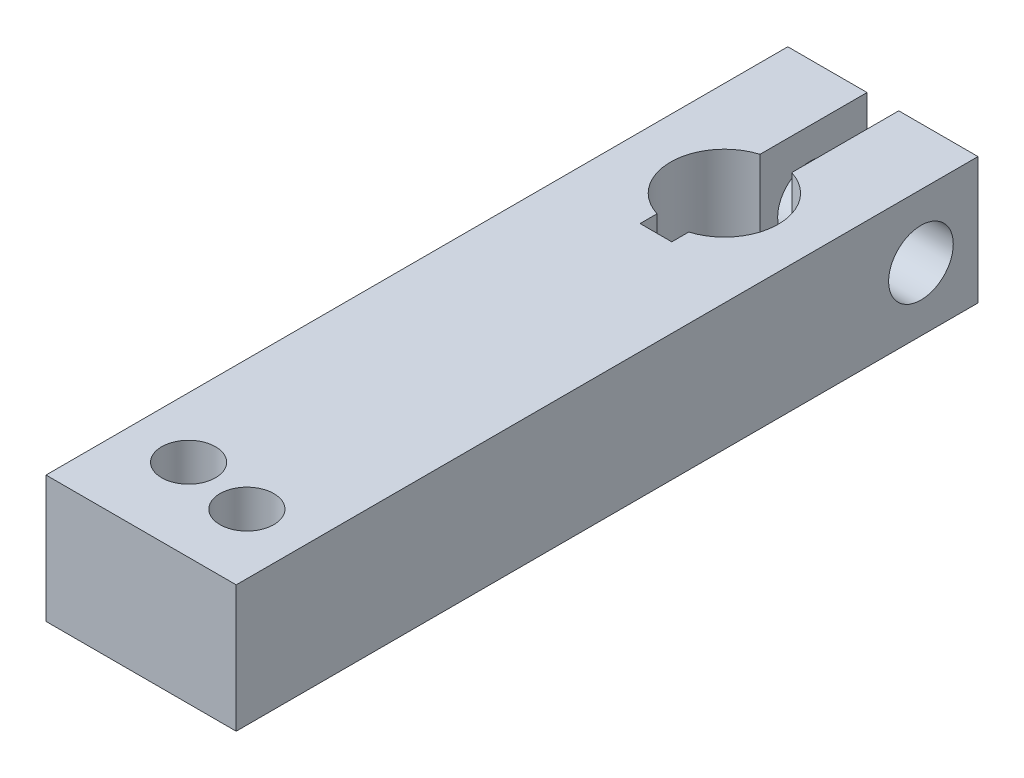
ISO-10303-21;
HEADER;
FILE_DESCRIPTION(('STEP AP214'),'2;1');
FILE_NAME('part.step','',(''),(''),'','','');
FILE_SCHEMA(('AUTOMOTIVE_DESIGN { 1 0 10303 214 1 1 1 1 }'));
ENDSEC;
DATA;
#1=APPLICATION_CONTEXT('core data for automotive mechanical design processes');
#2=APPLICATION_PROTOCOL_DEFINITION('international standard','automotive_design',2000,#1);
#3=PRODUCT_CONTEXT('',#1,'mechanical');
#4=PRODUCT('Part','Part','',(#3));
#5=PRODUCT_RELATED_PRODUCT_CATEGORY('part','',(#4));
#6=PRODUCT_DEFINITION_FORMATION('','',#4);
#7=PRODUCT_DEFINITION_CONTEXT('part definition',#1,'design');
#8=PRODUCT_DEFINITION('design','',#6,#7);
#9=PRODUCT_DEFINITION_SHAPE('','',#8);
#10=(LENGTH_UNIT() NAMED_UNIT(*) SI_UNIT(.MILLI.,.METRE.));
#11=(NAMED_UNIT(*) PLANE_ANGLE_UNIT() SI_UNIT($,.RADIAN.));
#12=(NAMED_UNIT(*) SI_UNIT($,.STERADIAN.) SOLID_ANGLE_UNIT());
#13=UNCERTAINTY_MEASURE_WITH_UNIT(LENGTH_MEASURE(1.E-05),#10,'distance_accuracy_value','');
#14=(GEOMETRIC_REPRESENTATION_CONTEXT(3) GLOBAL_UNCERTAINTY_ASSIGNED_CONTEXT((#13)) GLOBAL_UNIT_ASSIGNED_CONTEXT((#10,
#11,#12)) REPRESENTATION_CONTEXT('',''));
#15=CARTESIAN_POINT('',(0.,0.,0.));
#16=DIRECTION('',(0.,0.,1.));
#17=DIRECTION('',(1.,0.,0.));
#18=AXIS2_PLACEMENT_3D('',#15,#16,#17);
#19=CARTESIAN_POINT('',(-15.,-10.,-25.));
#20=DIRECTION('',(0.,0.,-1.));
#21=DIRECTION('',(-1.,0.,0.));
#22=AXIS2_PLACEMENT_3D('',#19,#20,#21);
#23=PLANE('',#22);
#24=DIRECTION('',(-1.,0.,0.));
#25=VECTOR('',#24,1.);
#26=CARTESIAN_POINT('',(-15.,10.,-25.));
#27=LINE('',#26,#25);
#28=CARTESIAN_POINT('',(-2.5,10.,-25.));
#29=VERTEX_POINT('',#28);
#30=CARTESIAN_POINT('',(-15.,10.,-25.));
#31=VERTEX_POINT('',#30);
#32=EDGE_CURVE('E105',#29,#31,#27,.T.);
#33=ORIENTED_EDGE('',*,*,#32,.F.);
#34=DIRECTION('',(0.,1.,0.));
#35=VECTOR('',#34,1.);
#36=CARTESIAN_POINT('',(-2.5,-10.,-25.));
#37=LINE('',#36,#35);
#38=CARTESIAN_POINT('',(-2.5,-10.,-25.));
#39=VERTEX_POINT('',#38);
#40=EDGE_CURVE('E32',#39,#29,#37,.T.);
#41=ORIENTED_EDGE('',*,*,#40,.F.);
#42=DIRECTION('',(-1.,0.,0.));
#43=VECTOR('',#42,1.);
#44=CARTESIAN_POINT('',(-15.,-10.,-25.));
#45=LINE('',#44,#43);
#46=CARTESIAN_POINT('',(-15.,-10.,-25.));
#47=VERTEX_POINT('',#46);
#48=EDGE_CURVE('E107',#39,#47,#45,.T.);
#49=ORIENTED_EDGE('',*,*,#48,.T.);
#50=DIRECTION('',(0.,1.,0.));
#51=VECTOR('',#50,1.);
#52=CARTESIAN_POINT('',(-15.,-10.,-25.));
#53=LINE('',#52,#51);
#54=EDGE_CURVE('E11',#47,#31,#53,.T.);
#55=ORIENTED_EDGE('',*,*,#54,.T.);
#56=EDGE_LOOP('',(#33,#41,#49,#55));
#57=FACE_BOUND('',#56,.T.);
#58=ADVANCED_FACE('F17',(#57),#23,.T.);
#59=CARTESIAN_POINT('',(-15.,-10.,-25.));
#60=DIRECTION('',(-1.,0.,0.));
#61=DIRECTION('',(0.,0.,1.));
#62=AXIS2_PLACEMENT_3D('',#59,#60,#61);
#63=PLANE('',#62);
#64=CARTESIAN_POINT('',(-15.,0.,-16.));
#65=DIRECTION('',(-1.,0.,0.));
#66=DIRECTION('',(0.,0.,1.));
#67=AXIS2_PLACEMENT_3D('',#64,#65,#66);
#68=CIRCLE('',#67,5.1);
#69=CARTESIAN_POINT('',(-15.,0.,-10.9));
#70=VERTEX_POINT('',#69);
#71=EDGE_CURVE('E125',#70,#70,#68,.T.);
#72=ORIENTED_EDGE('',*,*,#71,.F.);
#73=EDGE_LOOP('',(#72));
#74=FACE_BOUND('',#73,.T.);
#75=DIRECTION('',(0.,0.,1.));
#76=VECTOR('',#75,1.);
#77=CARTESIAN_POINT('',(-15.,10.,-25.));
#78=LINE('',#77,#76);
#79=CARTESIAN_POINT('',(-15.,10.,92.));
#80=VERTEX_POINT('',#79);
#81=EDGE_CURVE('E112',#31,#80,#78,.T.);
#82=ORIENTED_EDGE('',*,*,#81,.F.);
#83=ORIENTED_EDGE('',*,*,#54,.F.);
#84=DIRECTION('',(0.,0.,1.));
#85=VECTOR('',#84,1.);
#86=CARTESIAN_POINT('',(-15.,-10.,-25.));
#87=LINE('',#86,#85);
#88=CARTESIAN_POINT('',(-15.,-10.,92.));
#89=VERTEX_POINT('',#88);
#90=EDGE_CURVE('E136',#47,#89,#87,.T.);
#91=ORIENTED_EDGE('',*,*,#90,.T.);
#92=DIRECTION('',(0.,1.,0.));
#93=VECTOR('',#92,1.);
#94=CARTESIAN_POINT('',(-15.,-10.,92.));
#95=LINE('',#94,#93);
#96=EDGE_CURVE('E25',#89,#80,#95,.T.);
#97=ORIENTED_EDGE('',*,*,#96,.T.);
#98=EDGE_LOOP('',(#82,#83,#91,#97));
#99=FACE_BOUND('',#98,.T.);
#100=ADVANCED_FACE('F113',(#74,#99),#63,.T.);
#101=CARTESIAN_POINT('',(15.,-10.,92.));
#102=DIRECTION('',(0.,0.,1.));
#103=DIRECTION('',(1.,0.,0.));
#104=AXIS2_PLACEMENT_3D('',#101,#102,#103);
#105=PLANE('',#104);
#106=DIRECTION('',(1.,0.,0.));
#107=VECTOR('',#106,1.);
#108=CARTESIAN_POINT('',(15.,10.,92.));
#109=LINE('',#108,#107);
#110=CARTESIAN_POINT('',(15.,10.,92.));
#111=VERTEX_POINT('',#110);
#112=EDGE_CURVE('E118',#80,#111,#109,.T.);
#113=ORIENTED_EDGE('',*,*,#112,.F.);
#114=ORIENTED_EDGE('',*,*,#96,.F.);
#115=DIRECTION('',(1.,0.,0.));
#116=VECTOR('',#115,1.);
#117=CARTESIAN_POINT('',(15.,-10.,92.));
#118=LINE('',#117,#116);
#119=CARTESIAN_POINT('',(15.,-10.,92.));
#120=VERTEX_POINT('',#119);
#121=EDGE_CURVE('E138',#89,#120,#118,.T.);
#122=ORIENTED_EDGE('',*,*,#121,.T.);
#123=DIRECTION('',(0.,1.,0.));
#124=VECTOR('',#123,1.);
#125=CARTESIAN_POINT('',(15.,-10.,92.));
#126=LINE('',#125,#124);
#127=EDGE_CURVE('E183',#120,#111,#126,.T.);
#128=ORIENTED_EDGE('',*,*,#127,.T.);
#129=EDGE_LOOP('',(#113,#114,#122,#128));
#130=FACE_BOUND('',#129,.T.);
#131=ADVANCED_FACE('F187',(#130),#105,.T.);
#132=CARTESIAN_POINT('',(15.,-10.,-25.));
#133=DIRECTION('',(1.,0.,0.));
#134=DIRECTION('',(0.,0.,-1.));
#135=AXIS2_PLACEMENT_3D('',#132,#133,#134);
#136=PLANE('',#135);
#137=CARTESIAN_POINT('',(15.,0.,-16.));
#138=DIRECTION('',(1.,0.,0.));
#139=DIRECTION('',(0.,0.,-1.));
#140=AXIS2_PLACEMENT_3D('',#137,#138,#139);
#141=CIRCLE('',#140,5.1);
#142=CARTESIAN_POINT('',(15.,0.,-21.1));
#143=VERTEX_POINT('',#142);
#144=EDGE_CURVE('E131',#143,#143,#141,.T.);
#145=ORIENTED_EDGE('',*,*,#144,.F.);
#146=EDGE_LOOP('',(#145));
#147=FACE_BOUND('',#146,.T.);
#148=DIRECTION('',(0.,0.,-1.));
#149=VECTOR('',#148,1.);
#150=CARTESIAN_POINT('',(15.,10.,-25.));
#151=LINE('',#150,#149);
#152=CARTESIAN_POINT('',(15.,10.,-25.));
#153=VERTEX_POINT('',#152);
#154=EDGE_CURVE('E192',#111,#153,#151,.T.);
#155=ORIENTED_EDGE('',*,*,#154,.F.);
#156=ORIENTED_EDGE('',*,*,#127,.F.);
#157=DIRECTION('',(0.,0.,-1.));
#158=VECTOR('',#157,1.);
#159=CARTESIAN_POINT('',(15.,-10.,-25.));
#160=LINE('',#159,#158);
#161=CARTESIAN_POINT('',(15.,-10.,-25.));
#162=VERTEX_POINT('',#161);
#163=EDGE_CURVE('E141',#120,#162,#160,.T.);
#164=ORIENTED_EDGE('',*,*,#163,.T.);
#165=DIRECTION('',(0.,1.,0.));
#166=VECTOR('',#165,1.);
#167=CARTESIAN_POINT('',(15.,-10.,-25.));
#168=LINE('',#167,#166);
#169=EDGE_CURVE('E181',#162,#153,#168,.T.);
#170=ORIENTED_EDGE('',*,*,#169,.T.);
#171=EDGE_LOOP('',(#155,#156,#164,#170));
#172=FACE_BOUND('',#171,.T.);
#173=ADVANCED_FACE('F193',(#147,#172),#136,.T.);
#174=CARTESIAN_POINT('',(2.5,-10.,-25.));
#175=DIRECTION('',(0.,0.,-1.));
#176=DIRECTION('',(-1.,0.,0.));
#177=AXIS2_PLACEMENT_3D('',#174,#175,#176);
#178=PLANE('',#177);
#179=DIRECTION('',(-1.,0.,0.));
#180=VECTOR('',#179,1.);
#181=CARTESIAN_POINT('',(2.5,10.,-25.));
#182=LINE('',#181,#180);
#183=CARTESIAN_POINT('',(2.5,10.,-25.));
#184=VERTEX_POINT('',#183);
#185=EDGE_CURVE('E197',#153,#184,#182,.T.);
#186=ORIENTED_EDGE('',*,*,#185,.F.);
#187=ORIENTED_EDGE('',*,*,#169,.F.);
#188=DIRECTION('',(-1.,0.,0.));
#189=VECTOR('',#188,1.);
#190=CARTESIAN_POINT('',(2.5,-10.,-25.));
#191=LINE('',#190,#189);
#192=CARTESIAN_POINT('',(2.5,-10.,-25.));
#193=VERTEX_POINT('',#192);
#194=EDGE_CURVE('E144',#162,#193,#191,.T.);
#195=ORIENTED_EDGE('',*,*,#194,.T.);
#196=DIRECTION('',(0.,1.,0.));
#197=VECTOR('',#196,1.);
#198=CARTESIAN_POINT('',(2.5,-10.,-25.));
#199=LINE('',#198,#197);
#200=EDGE_CURVE('E179',#193,#184,#199,.T.);
#201=ORIENTED_EDGE('',*,*,#200,.T.);
#202=EDGE_LOOP('',(#186,#187,#195,#201));
#203=FACE_BOUND('',#202,.T.);
#204=ADVANCED_FACE('F244',(#203),#178,.T.);
#205=CARTESIAN_POINT('',(2.5,-10.,-25.));
#206=DIRECTION('',(-1.,0.,0.));
#207=DIRECTION('',(0.,0.,1.));
#208=AXIS2_PLACEMENT_3D('',#205,#206,#207);
#209=PLANE('',#208);
#210=CARTESIAN_POINT('',(2.5,0.,-16.));
#211=DIRECTION('',(-1.,0.,0.));
#212=DIRECTION('',(0.,0.,1.));
#213=AXIS2_PLACEMENT_3D('',#210,#211,#212);
#214=CIRCLE('',#213,5.1);
#215=CARTESIAN_POINT('',(2.5,0.,-10.9));
#216=VERTEX_POINT('',#215);
#217=EDGE_CURVE('E674',#216,#216,#214,.T.);
#218=ORIENTED_EDGE('',*,*,#217,.F.);
#219=EDGE_LOOP('',(#218));
#220=FACE_BOUND('',#219,.T.);
#221=DIRECTION('',(0.,0.,1.));
#222=VECTOR('',#221,1.);
#223=CARTESIAN_POINT('',(2.5,10.,-25.));
#224=LINE('',#223,#222);
#225=CARTESIAN_POINT('',(2.5,10.,-8.12403840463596));
#226=VERTEX_POINT('',#225);
#227=EDGE_CURVE('E205',#184,#226,#224,.T.);
#228=ORIENTED_EDGE('',*,*,#227,.F.);
#229=ORIENTED_EDGE('',*,*,#200,.F.);
#230=DIRECTION('',(0.,0.,1.));
#231=VECTOR('',#230,1.);
#232=CARTESIAN_POINT('',(2.5,-10.,-25.));
#233=LINE('',#232,#231);
#234=CARTESIAN_POINT('',(2.5,-10.,-8.12403840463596));
#235=VERTEX_POINT('',#234);
#236=EDGE_CURVE('E147',#193,#235,#233,.T.);
#237=ORIENTED_EDGE('',*,*,#236,.T.);
#238=DIRECTION('',(0.,1.,0.));
#239=VECTOR('',#238,1.);
#240=CARTESIAN_POINT('',(2.5,-10.,-8.12403840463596));
#241=LINE('',#240,#239);
#242=EDGE_CURVE('E177',#235,#226,#241,.T.);
#243=ORIENTED_EDGE('',*,*,#242,.T.);
#244=EDGE_LOOP('',(#228,#229,#237,#243));
#245=FACE_BOUND('',#244,.T.);
#246=ADVANCED_FACE('F248',(#220,#245),#209,.T.);
#247=CARTESIAN_POINT('',(0.,-10.,0.));
#248=DIRECTION('',(0.,1.,0.));
#249=DIRECTION('',(0.,0.,1.));
#250=AXIS2_PLACEMENT_3D('',#247,#248,#249);
#251=CYLINDRICAL_SURFACE('',#250,8.5);
#252=CARTESIAN_POINT('',(0.,10.,0.));
#253=DIRECTION('',(0.,-1.,0.));
#254=DIRECTION('',(-1.,0.,0.));
#255=AXIS2_PLACEMENT_3D('',#252,#253,#254);
#256=CIRCLE('',#255,8.5);
#257=CARTESIAN_POINT('',(2.5,10.,8.12403840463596));
#258=VERTEX_POINT('',#257);
#259=EDGE_CURVE('E209',#226,#258,#256,.T.);
#260=ORIENTED_EDGE('',*,*,#259,.F.);
#261=ORIENTED_EDGE('',*,*,#242,.F.);
#262=CARTESIAN_POINT('',(0.,-10.,0.));
#263=DIRECTION('',(0.,-1.,0.));
#264=DIRECTION('',(-1.,0.,0.));
#265=AXIS2_PLACEMENT_3D('',#262,#263,#264);
#266=CIRCLE('',#265,8.5);
#267=CARTESIAN_POINT('',(2.5,-10.,8.12403840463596));
#268=VERTEX_POINT('',#267);
#269=EDGE_CURVE('E150',#235,#268,#266,.T.);
#270=ORIENTED_EDGE('',*,*,#269,.T.);
#271=DIRECTION('',(0.,1.,0.));
#272=VECTOR('',#271,1.);
#273=CARTESIAN_POINT('',(2.5,-10.,8.12403840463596));
#274=LINE('',#273,#272);
#275=EDGE_CURVE('E175',#268,#258,#274,.T.);
#276=ORIENTED_EDGE('',*,*,#275,.T.);
#277=EDGE_LOOP('',(#260,#261,#270,#276));
#278=FACE_BOUND('',#277,.T.);
#279=ADVANCED_FACE('F250',(#278),#251,.F.);
#280=CARTESIAN_POINT('',(2.5,-10.,10.8));
#281=DIRECTION('',(-1.,0.,0.));
#282=DIRECTION('',(0.,0.,1.));
#283=AXIS2_PLACEMENT_3D('',#280,#281,#282);
#284=PLANE('',#283);
#285=DIRECTION('',(0.,0.,1.));
#286=VECTOR('',#285,1.);
#287=CARTESIAN_POINT('',(2.5,10.,10.8));
#288=LINE('',#287,#286);
#289=CARTESIAN_POINT('',(2.5,10.,10.8));
#290=VERTEX_POINT('',#289);
#291=EDGE_CURVE('E213',#258,#290,#288,.T.);
#292=ORIENTED_EDGE('',*,*,#291,.F.);
#293=ORIENTED_EDGE('',*,*,#275,.F.);
#294=DIRECTION('',(0.,0.,1.));
#295=VECTOR('',#294,1.);
#296=CARTESIAN_POINT('',(2.5,-10.,10.8));
#297=LINE('',#296,#295);
#298=CARTESIAN_POINT('',(2.5,-10.,10.8));
#299=VERTEX_POINT('',#298);
#300=EDGE_CURVE('E153',#268,#299,#297,.T.);
#301=ORIENTED_EDGE('',*,*,#300,.T.);
#302=DIRECTION('',(0.,1.,0.));
#303=VECTOR('',#302,1.);
#304=CARTESIAN_POINT('',(2.5,-10.,10.8));
#305=LINE('',#304,#303);
#306=EDGE_CURVE('E173',#299,#290,#305,.T.);
#307=ORIENTED_EDGE('',*,*,#306,.T.);
#308=EDGE_LOOP('',(#292,#293,#301,#307));
#309=FACE_BOUND('',#308,.T.);
#310=ADVANCED_FACE('F254',(#309),#284,.T.);
#311=CARTESIAN_POINT('',(-2.5,-10.,10.8));
#312=DIRECTION('',(0.,0.,-1.));
#313=DIRECTION('',(-1.,0.,0.));
#314=AXIS2_PLACEMENT_3D('',#311,#312,#313);
#315=PLANE('',#314);
#316=DIRECTION('',(-1.,0.,0.));
#317=VECTOR('',#316,1.);
#318=CARTESIAN_POINT('',(-2.5,10.,10.8));
#319=LINE('',#318,#317);
#320=CARTESIAN_POINT('',(-2.5,10.,10.8));
#321=VERTEX_POINT('',#320);
#322=EDGE_CURVE('E217',#290,#321,#319,.T.);
#323=ORIENTED_EDGE('',*,*,#322,.F.);
#324=ORIENTED_EDGE('',*,*,#306,.F.);
#325=DIRECTION('',(-1.,0.,0.));
#326=VECTOR('',#325,1.);
#327=CARTESIAN_POINT('',(-2.5,-10.,10.8));
#328=LINE('',#327,#326);
#329=CARTESIAN_POINT('',(-2.5,-10.,10.8));
#330=VERTEX_POINT('',#329);
#331=EDGE_CURVE('E156',#299,#330,#328,.T.);
#332=ORIENTED_EDGE('',*,*,#331,.T.);
#333=DIRECTION('',(0.,1.,0.));
#334=VECTOR('',#333,1.);
#335=CARTESIAN_POINT('',(-2.5,-10.,10.8));
#336=LINE('',#335,#334);
#337=EDGE_CURVE('E171',#330,#321,#336,.T.);
#338=ORIENTED_EDGE('',*,*,#337,.T.);
#339=EDGE_LOOP('',(#323,#324,#332,#338));
#340=FACE_BOUND('',#339,.T.);
#341=ADVANCED_FACE('F257',(#340),#315,.T.);
#342=CARTESIAN_POINT('',(-2.5,-10.,10.8));
#343=DIRECTION('',(1.,0.,0.));
#344=DIRECTION('',(0.,0.,-1.));
#345=AXIS2_PLACEMENT_3D('',#342,#343,#344);
#346=PLANE('',#345);
#347=DIRECTION('',(0.,0.,-1.));
#348=VECTOR('',#347,1.);
#349=CARTESIAN_POINT('',(-2.5,10.,10.8));
#350=LINE('',#349,#348);
#351=CARTESIAN_POINT('',(-2.5,10.,8.12403840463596));
#352=VERTEX_POINT('',#351);
#353=EDGE_CURVE('E221',#321,#352,#350,.T.);
#354=ORIENTED_EDGE('',*,*,#353,.F.);
#355=ORIENTED_EDGE('',*,*,#337,.F.);
#356=DIRECTION('',(0.,0.,-1.));
#357=VECTOR('',#356,1.);
#358=CARTESIAN_POINT('',(-2.5,-10.,10.8));
#359=LINE('',#358,#357);
#360=CARTESIAN_POINT('',(-2.5,-10.,8.12403840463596));
#361=VERTEX_POINT('',#360);
#362=EDGE_CURVE('E159',#330,#361,#359,.T.);
#363=ORIENTED_EDGE('',*,*,#362,.T.);
#364=DIRECTION('',(0.,1.,0.));
#365=VECTOR('',#364,1.);
#366=CARTESIAN_POINT('',(-2.5,-10.,8.12403840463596));
#367=LINE('',#366,#365);
#368=EDGE_CURVE('E169',#361,#352,#367,.T.);
#369=ORIENTED_EDGE('',*,*,#368,.T.);
#370=EDGE_LOOP('',(#354,#355,#363,#369));
#371=FACE_BOUND('',#370,.T.);
#372=ADVANCED_FACE('F261',(#371),#346,.T.);
#373=CARTESIAN_POINT('',(0.,-10.,0.));
#374=DIRECTION('',(0.,1.,0.));
#375=DIRECTION('',(0.,0.,1.));
#376=AXIS2_PLACEMENT_3D('',#373,#374,#375);
#377=CYLINDRICAL_SURFACE('',#376,8.5);
#378=CARTESIAN_POINT('',(0.,10.,0.));
#379=DIRECTION('',(0.,-1.,0.));
#380=DIRECTION('',(1.,0.,0.));
#381=AXIS2_PLACEMENT_3D('',#378,#379,#380);
#382=CIRCLE('',#381,8.5);
#383=CARTESIAN_POINT('',(-2.5,10.,-8.12403840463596));
#384=VERTEX_POINT('',#383);
#385=EDGE_CURVE('E224',#352,#384,#382,.T.);
#386=ORIENTED_EDGE('',*,*,#385,.F.);
#387=ORIENTED_EDGE('',*,*,#368,.F.);
#388=CARTESIAN_POINT('',(0.,-10.,0.));
#389=DIRECTION('',(0.,-1.,0.));
#390=DIRECTION('',(1.,0.,0.));
#391=AXIS2_PLACEMENT_3D('',#388,#389,#390);
#392=CIRCLE('',#391,8.5);
#393=CARTESIAN_POINT('',(-2.5,-10.,-8.12403840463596));
#394=VERTEX_POINT('',#393);
#395=EDGE_CURVE('E162',#361,#394,#392,.T.);
#396=ORIENTED_EDGE('',*,*,#395,.T.);
#397=DIRECTION('',(0.,1.,0.));
#398=VECTOR('',#397,1.);
#399=CARTESIAN_POINT('',(-2.5,-10.,-8.12403840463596));
#400=LINE('',#399,#398);
#401=EDGE_CURVE('E39',#394,#384,#400,.T.);
#402=ORIENTED_EDGE('',*,*,#401,.T.);
#403=EDGE_LOOP('',(#386,#387,#396,#402));
#404=FACE_BOUND('',#403,.T.);
#405=ADVANCED_FACE('F234',(#404),#377,.F.);
#406=CARTESIAN_POINT('',(-2.5,-10.,-25.));
#407=DIRECTION('',(1.,0.,0.));
#408=DIRECTION('',(0.,0.,-1.));
#409=AXIS2_PLACEMENT_3D('',#406,#407,#408);
#410=PLANE('',#409);
#411=CARTESIAN_POINT('',(-2.5,0.,-16.));
#412=DIRECTION('',(1.,0.,0.));
#413=DIRECTION('',(0.,0.,-1.));
#414=AXIS2_PLACEMENT_3D('',#411,#412,#413);
#415=CIRCLE('',#414,5.1);
#416=CARTESIAN_POINT('',(-2.5,0.,-21.1));
#417=VERTEX_POINT('',#416);
#418=EDGE_CURVE('E20',#417,#417,#415,.T.);
#419=ORIENTED_EDGE('',*,*,#418,.F.);
#420=EDGE_LOOP('',(#419));
#421=FACE_BOUND('',#420,.T.);
#422=DIRECTION('',(0.,0.,-1.));
#423=VECTOR('',#422,1.);
#424=CARTESIAN_POINT('',(-2.5,10.,-25.));
#425=LINE('',#424,#423);
#426=EDGE_CURVE('E123',#384,#29,#425,.T.);
#427=ORIENTED_EDGE('',*,*,#426,.F.);
#428=ORIENTED_EDGE('',*,*,#401,.F.);
#429=DIRECTION('',(0.,0.,-1.));
#430=VECTOR('',#429,1.);
#431=CARTESIAN_POINT('',(-2.5,-10.,-25.));
#432=LINE('',#431,#430);
#433=EDGE_CURVE('E164',#394,#39,#432,.T.);
#434=ORIENTED_EDGE('',*,*,#433,.T.);
#435=ORIENTED_EDGE('',*,*,#40,.T.);
#436=EDGE_LOOP('',(#427,#428,#434,#435));
#437=FACE_BOUND('',#436,.T.);
#438=ADVANCED_FACE('F237',(#421,#437),#410,.T.);
#439=CARTESIAN_POINT('',(0.,-10.,0.));
#440=DIRECTION('',(0.,-1.,0.));
#441=DIRECTION('',(0.,0.,-1.));
#442=AXIS2_PLACEMENT_3D('',#439,#440,#441);
#443=PLANE('',#442);
#444=CARTESIAN_POINT('',(-5.50000000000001,-10.,79.0087969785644));
#445=DIRECTION('',(0.,-1.,0.));
#446=DIRECTION('',(1.,0.,0.));
#447=AXIS2_PLACEMENT_3D('',#444,#445,#446);
#448=CIRCLE('',#447,4.25);
#449=CARTESIAN_POINT('',(-1.25000000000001,-10.,79.0087969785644));
#450=VERTEX_POINT('',#449);
#451=EDGE_CURVE('E662',#450,#450,#448,.T.);
#452=ORIENTED_EDGE('',*,*,#451,.F.);
#453=EDGE_LOOP('',(#452));
#454=FACE_BOUND('',#453,.T.);
#455=CARTESIAN_POINT('',(5.5,-10.,80.8130558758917));
#456=DIRECTION('',(0.,-1.,0.));
#457=DIRECTION('',(1.,0.,0.));
#458=AXIS2_PLACEMENT_3D('',#455,#456,#457);
#459=CIRCLE('',#458,4.25);
#460=CARTESIAN_POINT('',(9.75,-10.,80.8130558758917));
#461=VERTEX_POINT('',#460);
#462=EDGE_CURVE('E666',#461,#461,#459,.T.);
#463=ORIENTED_EDGE('',*,*,#462,.F.);
#464=EDGE_LOOP('',(#463));
#465=FACE_BOUND('',#464,.T.);
#466=ORIENTED_EDGE('',*,*,#48,.F.);
#467=ORIENTED_EDGE('',*,*,#433,.F.);
#468=ORIENTED_EDGE('',*,*,#395,.F.);
#469=ORIENTED_EDGE('',*,*,#362,.F.);
#470=ORIENTED_EDGE('',*,*,#331,.F.);
#471=ORIENTED_EDGE('',*,*,#300,.F.);
#472=ORIENTED_EDGE('',*,*,#269,.F.);
#473=ORIENTED_EDGE('',*,*,#236,.F.);
#474=ORIENTED_EDGE('',*,*,#194,.F.);
#475=ORIENTED_EDGE('',*,*,#163,.F.);
#476=ORIENTED_EDGE('',*,*,#121,.F.);
#477=ORIENTED_EDGE('',*,*,#90,.F.);
#478=EDGE_LOOP('',(#466,#467,#468,#469,#470,#471,#472,#473,#474,#475,#476,#477));
#479=FACE_BOUND('',#478,.T.);
#480=ADVANCED_FACE('F239',(#454,#465,#479),#443,.T.);
#481=CARTESIAN_POINT('',(0.,10.,0.));
#482=DIRECTION('',(0.,-1.,0.));
#483=DIRECTION('',(0.,0.,-1.));
#484=AXIS2_PLACEMENT_3D('',#481,#482,#483);
#485=PLANE('',#484);
#486=CARTESIAN_POINT('',(-5.50000000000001,9.99999999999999,79.0087969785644));
#487=DIRECTION('',(0.,-1.,0.));
#488=DIRECTION('',(0.,0.,-1.));
#489=AXIS2_PLACEMENT_3D('',#486,#487,#488);
#490=CIRCLE('',#489,4.25);
#491=CARTESIAN_POINT('',(-5.50000000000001,9.99999999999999,74.7587969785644));
#492=VERTEX_POINT('',#491);
#493=EDGE_CURVE('E659',#492,#492,#490,.T.);
#494=ORIENTED_EDGE('',*,*,#493,.T.);
#495=EDGE_LOOP('',(#494));
#496=FACE_BOUND('',#495,.T.);
#497=CARTESIAN_POINT('',(5.5,9.99999999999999,80.8130558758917));
#498=DIRECTION('',(0.,-1.,0.));
#499=DIRECTION('',(0.,0.,-1.));
#500=AXIS2_PLACEMENT_3D('',#497,#498,#499);
#501=CIRCLE('',#500,4.25);
#502=CARTESIAN_POINT('',(5.5,9.99999999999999,76.5630558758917));
#503=VERTEX_POINT('',#502);
#504=EDGE_CURVE('E671',#503,#503,#501,.T.);
#505=ORIENTED_EDGE('',*,*,#504,.T.);
#506=EDGE_LOOP('',(#505));
#507=FACE_BOUND('',#506,.T.);
#508=ORIENTED_EDGE('',*,*,#32,.T.);
#509=ORIENTED_EDGE('',*,*,#81,.T.);
#510=ORIENTED_EDGE('',*,*,#112,.T.);
#511=ORIENTED_EDGE('',*,*,#154,.T.);
#512=ORIENTED_EDGE('',*,*,#185,.T.);
#513=ORIENTED_EDGE('',*,*,#227,.T.);
#514=ORIENTED_EDGE('',*,*,#259,.T.);
#515=ORIENTED_EDGE('',*,*,#291,.T.);
#516=ORIENTED_EDGE('',*,*,#322,.T.);
#517=ORIENTED_EDGE('',*,*,#353,.T.);
#518=ORIENTED_EDGE('',*,*,#385,.T.);
#519=ORIENTED_EDGE('',*,*,#426,.T.);
#520=EDGE_LOOP('',(#508,#509,#510,#511,#512,#513,#514,#515,#516,#517,#518,#519));
#521=FACE_BOUND('',#520,.T.);
#522=ADVANCED_FACE('F121',(#496,#507,#521),#485,.F.);
#523=CARTESIAN_POINT('',(0.,0.,-16.));
#524=DIRECTION('',(1.,0.,0.));
#525=DIRECTION('',(0.,0.,1.));
#526=AXIS2_PLACEMENT_3D('',#523,#524,#525);
#527=CYLINDRICAL_SURFACE('',#526,5.1);
#528=ORIENTED_EDGE('',*,*,#71,.T.);
#529=EDGE_LOOP('',(#528));
#530=FACE_BOUND('',#529,.T.);
#531=ORIENTED_EDGE('',*,*,#418,.T.);
#532=EDGE_LOOP('',(#531));
#533=FACE_BOUND('',#532,.T.);
#534=ADVANCED_FACE('F348',(#530,#533),#527,.F.);
#535=ORIENTED_EDGE('',*,*,#144,.T.);
#536=EDGE_LOOP('',(#535));
#537=FACE_BOUND('',#536,.T.);
#538=ORIENTED_EDGE('',*,*,#217,.T.);
#539=EDGE_LOOP('',(#538));
#540=FACE_BOUND('',#539,.T.);
#541=ADVANCED_FACE('F359',(#537,#540),#527,.F.);
#542=CARTESIAN_POINT('',(5.5,112.429571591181,80.8130558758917));
#543=DIRECTION('',(0.,-1.,0.));
#544=DIRECTION('',(0.,0.,-1.));
#545=AXIS2_PLACEMENT_3D('',#542,#543,#544);
#546=CYLINDRICAL_SURFACE('',#545,4.25);
#547=ORIENTED_EDGE('',*,*,#504,.F.);
#548=EDGE_LOOP('',(#547));
#549=FACE_BOUND('',#548,.T.);
#550=ORIENTED_EDGE('',*,*,#462,.T.);
#551=EDGE_LOOP('',(#550));
#552=FACE_BOUND('',#551,.T.);
#553=ADVANCED_FACE('F370',(#549,#552),#546,.F.);
#554=CARTESIAN_POINT('',(-5.50000000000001,112.429571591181,79.0087969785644));
#555=DIRECTION('',(0.,-1.,0.));
#556=DIRECTION('',(0.,0.,-1.));
#557=AXIS2_PLACEMENT_3D('',#554,#555,#556);
#558=CYLINDRICAL_SURFACE('',#557,4.25);
#559=ORIENTED_EDGE('',*,*,#493,.F.);
#560=EDGE_LOOP('',(#559));
#561=FACE_BOUND('',#560,.T.);
#562=ORIENTED_EDGE('',*,*,#451,.T.);
#563=EDGE_LOOP('',(#562));
#564=FACE_BOUND('',#563,.T.);
#565=ADVANCED_FACE('F380',(#561,#564),#558,.F.);
#566=CLOSED_SHELL('',(#58,#100,#131,#173,#204,#246,#279,#310,#341,#372,#405,#438,#480,#522,#534,
#541,#553,#565));
#567=MANIFOLD_SOLID_BREP('B1',#566);
#568=ADVANCED_BREP_SHAPE_REPRESENTATION('',(#18,#567),#14);
#569=SHAPE_DEFINITION_REPRESENTATION(#9,#568);
ENDSEC;
END-ISO-10303-21;
